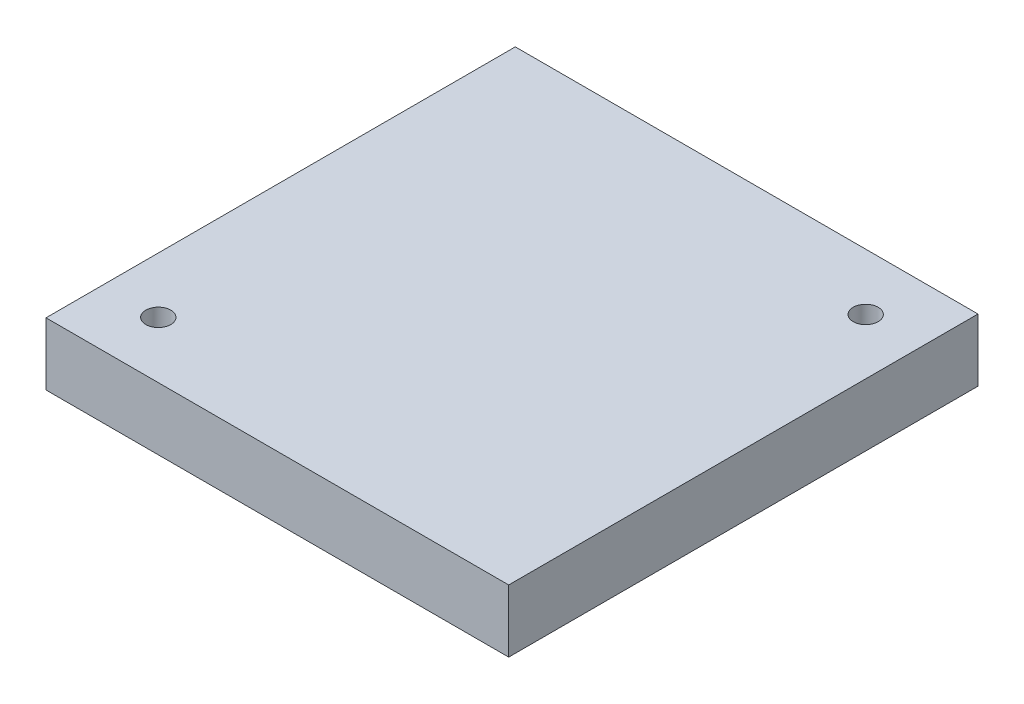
from build123d import *

# Parameters (mm, degrees)
SKETCH1_W           = 37
SKETCH1_H           = 37.527767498
BOSS_EXTRUDE1_DEPTH = 14
SKETCH2_W           = 37.527767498
SKETCH2_H           = 9
CUT_EXTRUDE1_DEPTH  = 44.784510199
SHELL1_T            = -2
SKETCH4_R           = 1
CUT_EXTRUDE2_DEPTH  = 26


with BuildPart() as part:
    # Sketch1 → Boss-Extrude1 (new body)
    with BuildSketch(Plane(origin=(0, 0, 0), x_dir=(1, 0, 0), z_dir=(0, 1, 0))):
        Rectangle(SKETCH1_W, SKETCH1_H)
    extrude(amount=BOSS_EXTRUDE1_DEPTH)

    # Sketch2 → Cut-Extrude1 (cut, through all)
    with BuildSketch(Plane.ZY.offset(18.5)):
        with Locations((0, 9.5)):
            Rectangle(SKETCH2_W, SKETCH2_H)
    extrude(amount=-CUT_EXTRUDE1_DEPTH, mode=Mode.SUBTRACT)

    # Shell1
    shell1_openings = [part.faces().sort_by_distance(p)[0] for p in [
        (0, 0, 0),
    ]]
    offset(amount=SHELL1_T, openings=shell1_openings, kind=Kind.INTERSECTION)

    # Sketch4 → Cut-Extrude2 (cut)
    with BuildSketch(Plane(origin=(0, 5, 0), x_dir=(1, 0, 0), z_dir=(0, 1, 0))):
        with Locations(Location((-14.041636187, -14.241925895, 0), (0, 0, 270))):
            Circle(SKETCH4_R)
        with Locations(Location((14.041636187, 14.241925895, 0), (0, 0, 270))):
            Circle(SKETCH4_R)
    extrude(amount=-CUT_EXTRUDE2_DEPTH, mode=Mode.SUBTRACT)


solid = part.part
